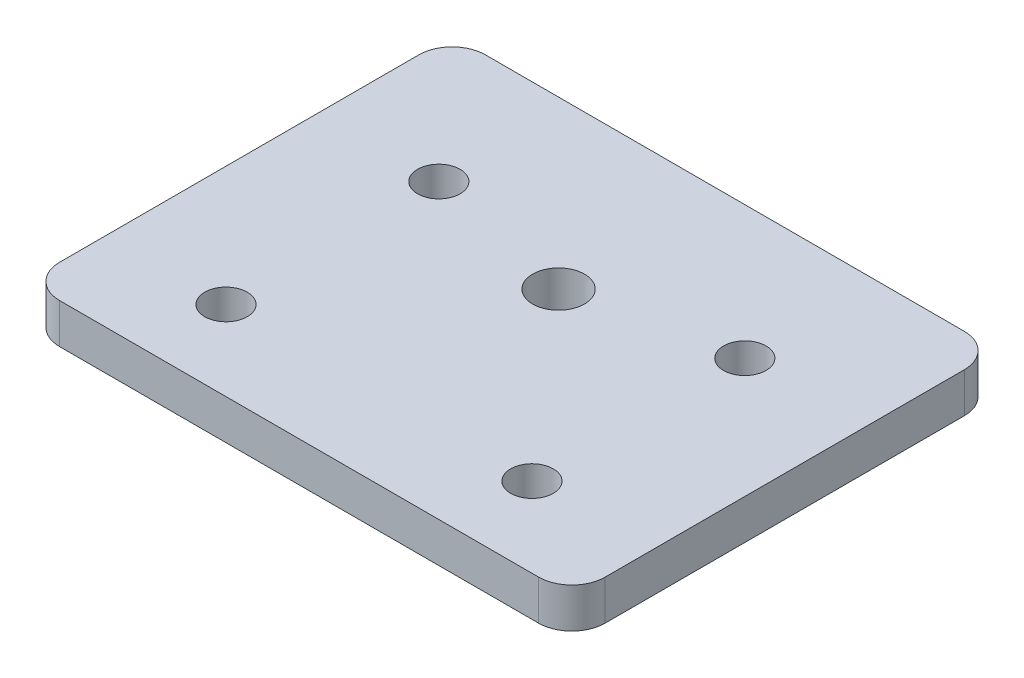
ISO-10303-21;
HEADER;
FILE_DESCRIPTION(('STEP AP214'),'2;1');
FILE_NAME('part.step','',(''),(''),'','','');
FILE_SCHEMA(('AUTOMOTIVE_DESIGN { 1 0 10303 214 1 1 1 1 }'));
ENDSEC;
DATA;
#1=APPLICATION_CONTEXT('core data for automotive mechanical design processes');
#2=APPLICATION_PROTOCOL_DEFINITION('international standard','automotive_design',2000,#1);
#3=PRODUCT_CONTEXT('',#1,'mechanical');
#4=PRODUCT('Part','Part','',(#3));
#5=PRODUCT_RELATED_PRODUCT_CATEGORY('part','',(#4));
#6=PRODUCT_DEFINITION_FORMATION('','',#4);
#7=PRODUCT_DEFINITION_CONTEXT('part definition',#1,'design');
#8=PRODUCT_DEFINITION('design','',#6,#7);
#9=PRODUCT_DEFINITION_SHAPE('','',#8);
#10=(LENGTH_UNIT() NAMED_UNIT(*) SI_UNIT(.MILLI.,.METRE.));
#11=(NAMED_UNIT(*) PLANE_ANGLE_UNIT() SI_UNIT($,.RADIAN.));
#12=(NAMED_UNIT(*) SI_UNIT($,.STERADIAN.) SOLID_ANGLE_UNIT());
#13=UNCERTAINTY_MEASURE_WITH_UNIT(LENGTH_MEASURE(1.E-05),#10,'distance_accuracy_value','');
#14=(GEOMETRIC_REPRESENTATION_CONTEXT(3) GLOBAL_UNCERTAINTY_ASSIGNED_CONTEXT((#13)) GLOBAL_UNIT_ASSIGNED_CONTEXT((#10,
#11,#12)) REPRESENTATION_CONTEXT('',''));
#15=CARTESIAN_POINT('',(0.,0.,0.));
#16=DIRECTION('',(0.,0.,1.));
#17=DIRECTION('',(1.,0.,0.));
#18=AXIS2_PLACEMENT_3D('',#15,#16,#17);
#19=CARTESIAN_POINT('',(-41.,6.,-32.));
#20=DIRECTION('',(1.,0.,0.));
#21=DIRECTION('',(0.,0.,-1.));
#22=AXIS2_PLACEMENT_3D('',#19,#20,#21);
#23=PLANE('',#22);
#24=DIRECTION('',(0.,0.,1.));
#25=VECTOR('',#24,1.);
#26=CARTESIAN_POINT('',(-41.,6.,-32.));
#27=LINE('',#26,#25);
#28=CARTESIAN_POINT('',(-41.,6.,-27.));
#29=VERTEX_POINT('',#28);
#30=CARTESIAN_POINT('',(-41.,6.,27.));
#31=VERTEX_POINT('',#30);
#32=EDGE_CURVE('E127',#29,#31,#27,.T.);
#33=ORIENTED_EDGE('',*,*,#32,.F.);
#34=DIRECTION('',(0.,-1.,0.));
#35=VECTOR('',#34,1.);
#36=CARTESIAN_POINT('',(-41.,6.,-27.));
#37=LINE('',#36,#35);
#38=CARTESIAN_POINT('',(-41.,0.,-27.));
#39=VERTEX_POINT('',#38);
#40=EDGE_CURVE('E11',#29,#39,#37,.T.);
#41=ORIENTED_EDGE('',*,*,#40,.T.);
#42=DIRECTION('',(0.,0.,1.));
#43=VECTOR('',#42,1.);
#44=CARTESIAN_POINT('',(-41.,0.,-32.));
#45=LINE('',#44,#43);
#46=CARTESIAN_POINT('',(-41.,0.,27.));
#47=VERTEX_POINT('',#46);
#48=EDGE_CURVE('E129',#39,#47,#45,.T.);
#49=ORIENTED_EDGE('',*,*,#48,.T.);
#50=DIRECTION('',(0.,-1.,0.));
#51=VECTOR('',#50,1.);
#52=CARTESIAN_POINT('',(-41.,6.,27.));
#53=LINE('',#52,#51);
#54=EDGE_CURVE('E40',#47,#31,#53,.F.);
#55=ORIENTED_EDGE('',*,*,#54,.T.);
#56=EDGE_LOOP('',(#33,#41,#49,#55));
#57=FACE_BOUND('',#56,.T.);
#58=ADVANCED_FACE('F32',(#57),#23,.F.);
#59=CARTESIAN_POINT('',(-41.,6.,32.));
#60=DIRECTION('',(0.,0.,-1.));
#61=DIRECTION('',(-1.,0.,0.));
#62=AXIS2_PLACEMENT_3D('',#59,#60,#61);
#63=PLANE('',#62);
#64=DIRECTION('',(1.,0.,0.));
#65=VECTOR('',#64,1.);
#66=CARTESIAN_POINT('',(-41.,0.,32.));
#67=LINE('',#66,#65);
#68=CARTESIAN_POINT('',(-36.,0.,32.));
#69=VERTEX_POINT('',#68);
#70=CARTESIAN_POINT('',(36.,0.,32.));
#71=VERTEX_POINT('',#70);
#72=EDGE_CURVE('E125',#69,#71,#67,.T.);
#73=ORIENTED_EDGE('',*,*,#72,.T.);
#74=DIRECTION('',(0.,-1.,0.));
#75=VECTOR('',#74,1.);
#76=CARTESIAN_POINT('',(36.,6.,32.));
#77=LINE('',#76,#75);
#78=CARTESIAN_POINT('',(36.,6.,32.));
#79=VERTEX_POINT('',#78);
#80=EDGE_CURVE('E104',#71,#79,#77,.F.);
#81=ORIENTED_EDGE('',*,*,#80,.T.);
#82=DIRECTION('',(1.,0.,0.));
#83=VECTOR('',#82,1.);
#84=CARTESIAN_POINT('',(-41.,6.,32.));
#85=LINE('',#84,#83);
#86=CARTESIAN_POINT('',(-36.,6.,32.));
#87=VERTEX_POINT('',#86);
#88=EDGE_CURVE('E185',#87,#79,#85,.T.);
#89=ORIENTED_EDGE('',*,*,#88,.F.);
#90=DIRECTION('',(0.,-1.,0.));
#91=VECTOR('',#90,1.);
#92=CARTESIAN_POINT('',(-36.,6.,32.));
#93=LINE('',#92,#91);
#94=EDGE_CURVE('E109',#87,#69,#93,.T.);
#95=ORIENTED_EDGE('',*,*,#94,.T.);
#96=EDGE_LOOP('',(#73,#81,#89,#95));
#97=FACE_BOUND('',#96,.T.);
#98=ADVANCED_FACE('F189',(#97),#63,.F.);
#99=CARTESIAN_POINT('',(41.,6.,-32.));
#100=DIRECTION('',(-1.,0.,0.));
#101=DIRECTION('',(0.,0.,1.));
#102=AXIS2_PLACEMENT_3D('',#99,#100,#101);
#103=PLANE('',#102);
#104=DIRECTION('',(0.,0.,-1.));
#105=VECTOR('',#104,1.);
#106=CARTESIAN_POINT('',(41.,6.,-32.));
#107=LINE('',#106,#105);
#108=CARTESIAN_POINT('',(41.,6.,27.));
#109=VERTEX_POINT('',#108);
#110=CARTESIAN_POINT('',(41.,6.,-27.));
#111=VERTEX_POINT('',#110);
#112=EDGE_CURVE('E118',#109,#111,#107,.T.);
#113=ORIENTED_EDGE('',*,*,#112,.F.);
#114=DIRECTION('',(0.,-1.,0.));
#115=VECTOR('',#114,1.);
#116=CARTESIAN_POINT('',(41.,6.,27.));
#117=LINE('',#116,#115);
#118=CARTESIAN_POINT('',(41.,0.,27.));
#119=VERTEX_POINT('',#118);
#120=EDGE_CURVE('E103',#109,#119,#117,.T.);
#121=ORIENTED_EDGE('',*,*,#120,.T.);
#122=DIRECTION('',(0.,0.,-1.));
#123=VECTOR('',#122,1.);
#124=CARTESIAN_POINT('',(41.,0.,-32.));
#125=LINE('',#124,#123);
#126=CARTESIAN_POINT('',(41.,0.,-27.));
#127=VERTEX_POINT('',#126);
#128=EDGE_CURVE('E116',#119,#127,#125,.T.);
#129=ORIENTED_EDGE('',*,*,#128,.T.);
#130=DIRECTION('',(0.,-1.,0.));
#131=VECTOR('',#130,1.);
#132=CARTESIAN_POINT('',(41.,6.,-27.));
#133=LINE('',#132,#131);
#134=EDGE_CURVE('E120',#127,#111,#133,.F.);
#135=ORIENTED_EDGE('',*,*,#134,.T.);
#136=EDGE_LOOP('',(#113,#121,#129,#135));
#137=FACE_BOUND('',#136,.T.);
#138=ADVANCED_FACE('F115',(#137),#103,.F.);
#139=CARTESIAN_POINT('',(-41.,6.,-32.));
#140=DIRECTION('',(0.,0.,1.));
#141=DIRECTION('',(1.,0.,0.));
#142=AXIS2_PLACEMENT_3D('',#139,#140,#141);
#143=PLANE('',#142);
#144=DIRECTION('',(-1.,0.,0.));
#145=VECTOR('',#144,1.);
#146=CARTESIAN_POINT('',(-41.,6.,-32.));
#147=LINE('',#146,#145);
#148=CARTESIAN_POINT('',(36.,6.,-32.));
#149=VERTEX_POINT('',#148);
#150=CARTESIAN_POINT('',(-36.,6.,-32.));
#151=VERTEX_POINT('',#150);
#152=EDGE_CURVE('E153',#149,#151,#147,.T.);
#153=ORIENTED_EDGE('',*,*,#152,.F.);
#154=DIRECTION('',(0.,-1.,0.));
#155=VECTOR('',#154,1.);
#156=CARTESIAN_POINT('',(36.,6.,-32.));
#157=LINE('',#156,#155);
#158=CARTESIAN_POINT('',(36.,0.,-32.));
#159=VERTEX_POINT('',#158);
#160=EDGE_CURVE('E170',#149,#159,#157,.T.);
#161=ORIENTED_EDGE('',*,*,#160,.T.);
#162=DIRECTION('',(-1.,0.,0.));
#163=VECTOR('',#162,1.);
#164=CARTESIAN_POINT('',(-41.,0.,-32.));
#165=LINE('',#164,#163);
#166=CARTESIAN_POINT('',(-36.,0.,-32.));
#167=VERTEX_POINT('',#166);
#168=EDGE_CURVE('E124',#159,#167,#165,.T.);
#169=ORIENTED_EDGE('',*,*,#168,.T.);
#170=DIRECTION('',(0.,-1.,0.));
#171=VECTOR('',#170,1.);
#172=CARTESIAN_POINT('',(-36.,6.,-32.));
#173=LINE('',#172,#171);
#174=EDGE_CURVE('E47',#167,#151,#173,.F.);
#175=ORIENTED_EDGE('',*,*,#174,.T.);
#176=EDGE_LOOP('',(#153,#161,#169,#175));
#177=FACE_BOUND('',#176,.T.);
#178=ADVANCED_FACE('F210',(#177),#143,.F.);
#179=CARTESIAN_POINT('',(-41.,6.,32.));
#180=DIRECTION('',(0.,1.,0.));
#181=DIRECTION('',(0.,0.,1.));
#182=AXIS2_PLACEMENT_3D('',#179,#180,#181);
#183=PLANE('',#182);
#184=CARTESIAN_POINT('',(0.,6.,-7.));
#185=DIRECTION('',(0.,1.,0.));
#186=DIRECTION('',(0.,0.,1.));
#187=AXIS2_PLACEMENT_3D('',#184,#185,#186);
#188=CIRCLE('',#187,3.9);
#189=CARTESIAN_POINT('',(0.,6.,-3.1));
#190=VERTEX_POINT('',#189);
#191=EDGE_CURVE('E152',#190,#190,#188,.T.);
#192=ORIENTED_EDGE('',*,*,#191,.F.);
#193=EDGE_LOOP('',(#192));
#194=FACE_BOUND('',#193,.T.);
#195=CARTESIAN_POINT('',(-23.,6.,20.));
#196=DIRECTION('',(0.,1.,0.));
#197=DIRECTION('',(0.,0.,1.));
#198=AXIS2_PLACEMENT_3D('',#195,#196,#197);
#199=CIRCLE('',#198,3.2);
#200=CARTESIAN_POINT('',(-23.,6.,23.2));
#201=VERTEX_POINT('',#200);
#202=EDGE_CURVE('E148',#201,#201,#199,.T.);
#203=ORIENTED_EDGE('',*,*,#202,.F.);
#204=EDGE_LOOP('',(#203));
#205=FACE_BOUND('',#204,.T.);
#206=CARTESIAN_POINT('',(23.,6.,20.));
#207=DIRECTION('',(0.,1.,0.));
#208=DIRECTION('',(0.,0.,1.));
#209=AXIS2_PLACEMENT_3D('',#206,#207,#208);
#210=CIRCLE('',#209,3.2);
#211=CARTESIAN_POINT('',(23.,6.,23.2));
#212=VERTEX_POINT('',#211);
#213=EDGE_CURVE('E144',#212,#212,#210,.T.);
#214=ORIENTED_EDGE('',*,*,#213,.F.);
#215=EDGE_LOOP('',(#214));
#216=FACE_BOUND('',#215,.T.);
#217=CARTESIAN_POINT('',(-23.,6.,-12.));
#218=DIRECTION('',(0.,1.,0.));
#219=DIRECTION('',(0.,0.,1.));
#220=AXIS2_PLACEMENT_3D('',#217,#218,#219);
#221=CIRCLE('',#220,3.2);
#222=CARTESIAN_POINT('',(-23.,6.,-8.8));
#223=VERTEX_POINT('',#222);
#224=EDGE_CURVE('E140',#223,#223,#221,.T.);
#225=ORIENTED_EDGE('',*,*,#224,.F.);
#226=EDGE_LOOP('',(#225));
#227=FACE_BOUND('',#226,.T.);
#228=CARTESIAN_POINT('',(23.,6.,-12.));
#229=DIRECTION('',(0.,1.,0.));
#230=DIRECTION('',(0.,0.,1.));
#231=AXIS2_PLACEMENT_3D('',#228,#229,#230);
#232=CIRCLE('',#231,3.2);
#233=CARTESIAN_POINT('',(23.,6.,-8.8));
#234=VERTEX_POINT('',#233);
#235=EDGE_CURVE('E136',#234,#234,#232,.T.);
#236=ORIENTED_EDGE('',*,*,#235,.F.);
#237=EDGE_LOOP('',(#236));
#238=FACE_BOUND('',#237,.T.);
#239=ORIENTED_EDGE('',*,*,#88,.T.);
#240=CARTESIAN_POINT('',(36.,6.,27.));
#241=DIRECTION('',(0.,1.,0.));
#242=DIRECTION('',(0.,0.,1.));
#243=AXIS2_PLACEMENT_3D('',#240,#241,#242);
#244=CIRCLE('',#243,5.);
#245=EDGE_CURVE('E167',#79,#109,#244,.T.);
#246=ORIENTED_EDGE('',*,*,#245,.T.);
#247=ORIENTED_EDGE('',*,*,#112,.T.);
#248=CARTESIAN_POINT('',(36.,6.,-27.));
#249=DIRECTION('',(0.,1.,0.));
#250=DIRECTION('',(0.,0.,1.));
#251=AXIS2_PLACEMENT_3D('',#248,#249,#250);
#252=CIRCLE('',#251,5.);
#253=EDGE_CURVE('E54',#111,#149,#252,.T.);
#254=ORIENTED_EDGE('',*,*,#253,.T.);
#255=ORIENTED_EDGE('',*,*,#152,.T.);
#256=CARTESIAN_POINT('',(-36.,6.,-27.));
#257=DIRECTION('',(0.,1.,0.));
#258=DIRECTION('',(0.,0.,1.));
#259=AXIS2_PLACEMENT_3D('',#256,#257,#258);
#260=CIRCLE('',#259,5.);
#261=EDGE_CURVE('E164',#151,#29,#260,.T.);
#262=ORIENTED_EDGE('',*,*,#261,.T.);
#263=ORIENTED_EDGE('',*,*,#32,.T.);
#264=CARTESIAN_POINT('',(-36.,6.,27.));
#265=DIRECTION('',(0.,1.,0.));
#266=DIRECTION('',(0.,0.,1.));
#267=AXIS2_PLACEMENT_3D('',#264,#265,#266);
#268=CIRCLE('',#267,5.);
#269=EDGE_CURVE('E162',#31,#87,#268,.T.);
#270=ORIENTED_EDGE('',*,*,#269,.T.);
#271=EDGE_LOOP('',(#239,#246,#247,#254,#255,#262,#263,#270));
#272=FACE_BOUND('',#271,.T.);
#273=ADVANCED_FACE('F182',(#194,#205,#216,#227,#238,#272),#183,.T.);
#274=CARTESIAN_POINT('',(-41.,0.,32.));
#275=DIRECTION('',(0.,1.,0.));
#276=DIRECTION('',(0.,0.,1.));
#277=AXIS2_PLACEMENT_3D('',#274,#275,#276);
#278=PLANE('',#277);
#279=CARTESIAN_POINT('',(0.,0.,-7.));
#280=DIRECTION('',(0.,1.,0.));
#281=DIRECTION('',(0.,0.,1.));
#282=AXIS2_PLACEMENT_3D('',#279,#280,#281);
#283=CIRCLE('',#282,3.9);
#284=CARTESIAN_POINT('',(0.,0.,-3.1));
#285=VERTEX_POINT('',#284);
#286=EDGE_CURVE('E149',#285,#285,#283,.T.);
#287=ORIENTED_EDGE('',*,*,#286,.T.);
#288=EDGE_LOOP('',(#287));
#289=FACE_BOUND('',#288,.T.);
#290=CARTESIAN_POINT('',(-23.,0.,20.));
#291=DIRECTION('',(0.,1.,0.));
#292=DIRECTION('',(0.,0.,1.));
#293=AXIS2_PLACEMENT_3D('',#290,#291,#292);
#294=CIRCLE('',#293,3.2);
#295=CARTESIAN_POINT('',(-23.,0.,23.2));
#296=VERTEX_POINT('',#295);
#297=EDGE_CURVE('E145',#296,#296,#294,.T.);
#298=ORIENTED_EDGE('',*,*,#297,.T.);
#299=EDGE_LOOP('',(#298));
#300=FACE_BOUND('',#299,.T.);
#301=CARTESIAN_POINT('',(23.,0.,20.));
#302=DIRECTION('',(0.,1.,0.));
#303=DIRECTION('',(0.,0.,1.));
#304=AXIS2_PLACEMENT_3D('',#301,#302,#303);
#305=CIRCLE('',#304,3.2);
#306=CARTESIAN_POINT('',(23.,0.,23.2));
#307=VERTEX_POINT('',#306);
#308=EDGE_CURVE('E141',#307,#307,#305,.T.);
#309=ORIENTED_EDGE('',*,*,#308,.T.);
#310=EDGE_LOOP('',(#309));
#311=FACE_BOUND('',#310,.T.);
#312=CARTESIAN_POINT('',(-23.,0.,-12.));
#313=DIRECTION('',(0.,1.,0.));
#314=DIRECTION('',(0.,0.,1.));
#315=AXIS2_PLACEMENT_3D('',#312,#313,#314);
#316=CIRCLE('',#315,3.2);
#317=CARTESIAN_POINT('',(-23.,0.,-8.8));
#318=VERTEX_POINT('',#317);
#319=EDGE_CURVE('E137',#318,#318,#316,.T.);
#320=ORIENTED_EDGE('',*,*,#319,.T.);
#321=EDGE_LOOP('',(#320));
#322=FACE_BOUND('',#321,.T.);
#323=CARTESIAN_POINT('',(23.,0.,-12.));
#324=DIRECTION('',(0.,1.,0.));
#325=DIRECTION('',(0.,0.,1.));
#326=AXIS2_PLACEMENT_3D('',#323,#324,#325);
#327=CIRCLE('',#326,3.2);
#328=CARTESIAN_POINT('',(23.,0.,-8.8));
#329=VERTEX_POINT('',#328);
#330=EDGE_CURVE('E133',#329,#329,#327,.T.);
#331=ORIENTED_EDGE('',*,*,#330,.T.);
#332=EDGE_LOOP('',(#331));
#333=FACE_BOUND('',#332,.T.);
#334=ORIENTED_EDGE('',*,*,#128,.F.);
#335=CARTESIAN_POINT('',(36.,0.,27.));
#336=DIRECTION('',(0.,1.,0.));
#337=DIRECTION('',(0.,0.,1.));
#338=AXIS2_PLACEMENT_3D('',#335,#336,#337);
#339=CIRCLE('',#338,5.);
#340=EDGE_CURVE('E99',#119,#71,#339,.F.);
#341=ORIENTED_EDGE('',*,*,#340,.T.);
#342=ORIENTED_EDGE('',*,*,#72,.F.);
#343=CARTESIAN_POINT('',(-36.,0.,27.));
#344=DIRECTION('',(0.,1.,0.));
#345=DIRECTION('',(0.,0.,1.));
#346=AXIS2_PLACEMENT_3D('',#343,#344,#345);
#347=CIRCLE('',#346,5.);
#348=EDGE_CURVE('E119',#69,#47,#347,.F.);
#349=ORIENTED_EDGE('',*,*,#348,.T.);
#350=ORIENTED_EDGE('',*,*,#48,.F.);
#351=CARTESIAN_POINT('',(-36.,0.,-27.));
#352=DIRECTION('',(0.,1.,0.));
#353=DIRECTION('',(0.,0.,1.));
#354=AXIS2_PLACEMENT_3D('',#351,#352,#353);
#355=CIRCLE('',#354,5.);
#356=EDGE_CURVE('E156',#39,#167,#355,.F.);
#357=ORIENTED_EDGE('',*,*,#356,.T.);
#358=ORIENTED_EDGE('',*,*,#168,.F.);
#359=CARTESIAN_POINT('',(36.,0.,-27.));
#360=DIRECTION('',(0.,1.,0.));
#361=DIRECTION('',(0.,0.,1.));
#362=AXIS2_PLACEMENT_3D('',#359,#360,#361);
#363=CIRCLE('',#362,5.);
#364=EDGE_CURVE('E110',#159,#127,#363,.F.);
#365=ORIENTED_EDGE('',*,*,#364,.T.);
#366=EDGE_LOOP('',(#334,#341,#342,#349,#350,#357,#358,#365));
#367=FACE_BOUND('',#366,.T.);
#368=ADVANCED_FACE('F122',(#289,#300,#311,#322,#333,#367),#278,.F.);
#369=CARTESIAN_POINT('',(23.,-4.,-12.));
#370=DIRECTION('',(0.,1.,0.));
#371=DIRECTION('',(0.,0.,1.));
#372=AXIS2_PLACEMENT_3D('',#369,#370,#371);
#373=CYLINDRICAL_SURFACE('',#372,3.2);
#374=ORIENTED_EDGE('',*,*,#235,.T.);
#375=EDGE_LOOP('',(#374));
#376=FACE_BOUND('',#375,.T.);
#377=ORIENTED_EDGE('',*,*,#330,.F.);
#378=EDGE_LOOP('',(#377));
#379=FACE_BOUND('',#378,.T.);
#380=ADVANCED_FACE('F220',(#376,#379),#373,.F.);
#381=CARTESIAN_POINT('',(-23.,-4.,-12.));
#382=DIRECTION('',(0.,1.,0.));
#383=DIRECTION('',(0.,0.,1.));
#384=AXIS2_PLACEMENT_3D('',#381,#382,#383);
#385=CYLINDRICAL_SURFACE('',#384,3.2);
#386=ORIENTED_EDGE('',*,*,#224,.T.);
#387=EDGE_LOOP('',(#386));
#388=FACE_BOUND('',#387,.T.);
#389=ORIENTED_EDGE('',*,*,#319,.F.);
#390=EDGE_LOOP('',(#389));
#391=FACE_BOUND('',#390,.T.);
#392=ADVANCED_FACE('F223',(#388,#391),#385,.F.);
#393=CARTESIAN_POINT('',(23.,-4.,20.));
#394=DIRECTION('',(0.,1.,0.));
#395=DIRECTION('',(0.,0.,1.));
#396=AXIS2_PLACEMENT_3D('',#393,#394,#395);
#397=CYLINDRICAL_SURFACE('',#396,3.2);
#398=ORIENTED_EDGE('',*,*,#213,.T.);
#399=EDGE_LOOP('',(#398));
#400=FACE_BOUND('',#399,.T.);
#401=ORIENTED_EDGE('',*,*,#308,.F.);
#402=EDGE_LOOP('',(#401));
#403=FACE_BOUND('',#402,.T.);
#404=ADVANCED_FACE('F324',(#400,#403),#397,.F.);
#405=CARTESIAN_POINT('',(-23.,-4.,20.));
#406=DIRECTION('',(0.,1.,0.));
#407=DIRECTION('',(0.,0.,1.));
#408=AXIS2_PLACEMENT_3D('',#405,#406,#407);
#409=CYLINDRICAL_SURFACE('',#408,3.2);
#410=ORIENTED_EDGE('',*,*,#202,.T.);
#411=EDGE_LOOP('',(#410));
#412=FACE_BOUND('',#411,.T.);
#413=ORIENTED_EDGE('',*,*,#297,.F.);
#414=EDGE_LOOP('',(#413));
#415=FACE_BOUND('',#414,.T.);
#416=ADVANCED_FACE('F315',(#412,#415),#409,.F.);
#417=CARTESIAN_POINT('',(0.,-4.,-7.));
#418=DIRECTION('',(0.,1.,0.));
#419=DIRECTION('',(0.,0.,1.));
#420=AXIS2_PLACEMENT_3D('',#417,#418,#419);
#421=CYLINDRICAL_SURFACE('',#420,3.9);
#422=ORIENTED_EDGE('',*,*,#191,.T.);
#423=EDGE_LOOP('',(#422));
#424=FACE_BOUND('',#423,.T.);
#425=ORIENTED_EDGE('',*,*,#286,.F.);
#426=EDGE_LOOP('',(#425));
#427=FACE_BOUND('',#426,.T.);
#428=ADVANCED_FACE('F205',(#424,#427),#421,.F.);
#429=CARTESIAN_POINT('',(36.,6.,27.));
#430=DIRECTION('',(0.,-1.,0.));
#431=DIRECTION('',(0.,0.,-1.));
#432=AXIS2_PLACEMENT_3D('',#429,#430,#431);
#433=CYLINDRICAL_SURFACE('',#432,5.);
#434=ORIENTED_EDGE('',*,*,#245,.F.);
#435=ORIENTED_EDGE('',*,*,#80,.F.);
#436=ORIENTED_EDGE('',*,*,#340,.F.);
#437=ORIENTED_EDGE('',*,*,#120,.F.);
#438=EDGE_LOOP('',(#434,#435,#436,#437));
#439=FACE_BOUND('',#438,.T.);
#440=ADVANCED_FACE('F102',(#439),#433,.T.);
#441=CARTESIAN_POINT('',(36.,6.,-27.));
#442=DIRECTION('',(0.,-1.,0.));
#443=DIRECTION('',(0.,0.,-1.));
#444=AXIS2_PLACEMENT_3D('',#441,#442,#443);
#445=CYLINDRICAL_SURFACE('',#444,5.);
#446=ORIENTED_EDGE('',*,*,#253,.F.);
#447=ORIENTED_EDGE('',*,*,#134,.F.);
#448=ORIENTED_EDGE('',*,*,#364,.F.);
#449=ORIENTED_EDGE('',*,*,#160,.F.);
#450=EDGE_LOOP('',(#446,#447,#448,#449));
#451=FACE_BOUND('',#450,.T.);
#452=ADVANCED_FACE('F244',(#451),#445,.T.);
#453=CARTESIAN_POINT('',(-36.,6.,-27.));
#454=DIRECTION('',(0.,-1.,0.));
#455=DIRECTION('',(0.,0.,-1.));
#456=AXIS2_PLACEMENT_3D('',#453,#454,#455);
#457=CYLINDRICAL_SURFACE('',#456,5.);
#458=ORIENTED_EDGE('',*,*,#261,.F.);
#459=ORIENTED_EDGE('',*,*,#174,.F.);
#460=ORIENTED_EDGE('',*,*,#356,.F.);
#461=ORIENTED_EDGE('',*,*,#40,.F.);
#462=EDGE_LOOP('',(#458,#459,#460,#461));
#463=FACE_BOUND('',#462,.T.);
#464=ADVANCED_FACE('F246',(#463),#457,.T.);
#465=CARTESIAN_POINT('',(-36.,6.,27.));
#466=DIRECTION('',(0.,-1.,0.));
#467=DIRECTION('',(0.,0.,-1.));
#468=AXIS2_PLACEMENT_3D('',#465,#466,#467);
#469=CYLINDRICAL_SURFACE('',#468,5.);
#470=ORIENTED_EDGE('',*,*,#269,.F.);
#471=ORIENTED_EDGE('',*,*,#54,.F.);
#472=ORIENTED_EDGE('',*,*,#348,.F.);
#473=ORIENTED_EDGE('',*,*,#94,.F.);
#474=EDGE_LOOP('',(#470,#471,#472,#473));
#475=FACE_BOUND('',#474,.T.);
#476=ADVANCED_FACE('F34',(#475),#469,.T.);
#477=CLOSED_SHELL('',(#58,#98,#138,#178,#273,#368,#380,#392,#404,#416,#428,#440,#452,#464,#476));
#478=MANIFOLD_SOLID_BREP('B2',#477);
#479=ADVANCED_BREP_SHAPE_REPRESENTATION('',(#18,#478),#14);
#480=SHAPE_DEFINITION_REPRESENTATION(#9,#479);
ENDSEC;
END-ISO-10303-21;
